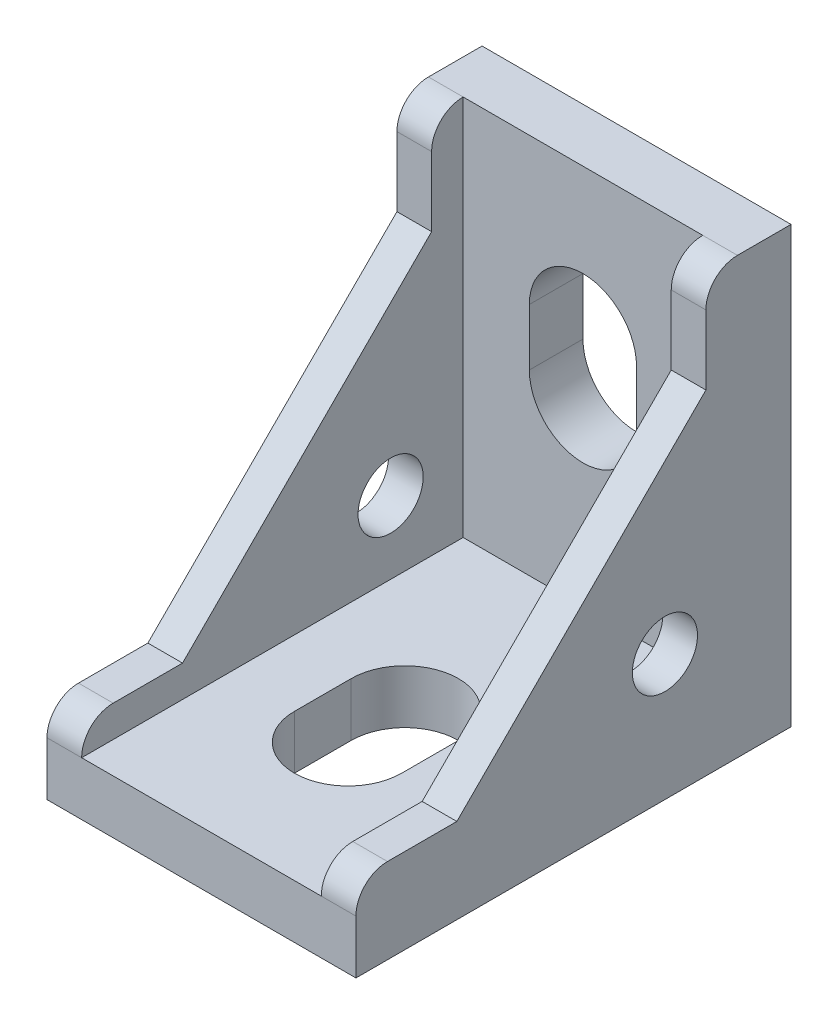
ISO-10303-21;
HEADER;
FILE_DESCRIPTION(('STEP AP214'),'2;1');
FILE_NAME('part.step','',(''),(''),'','','');
FILE_SCHEMA(('AUTOMOTIVE_DESIGN { 1 0 10303 214 1 1 1 1 }'));
ENDSEC;
DATA;
#1=APPLICATION_CONTEXT('core data for automotive mechanical design processes');
#2=APPLICATION_PROTOCOL_DEFINITION('international standard','automotive_design',2000,#1);
#3=PRODUCT_CONTEXT('',#1,'mechanical');
#4=PRODUCT('Part','Part','',(#3));
#5=PRODUCT_RELATED_PRODUCT_CATEGORY('part','',(#4));
#6=PRODUCT_DEFINITION_FORMATION('','',#4);
#7=PRODUCT_DEFINITION_CONTEXT('part definition',#1,'design');
#8=PRODUCT_DEFINITION('design','',#6,#7);
#9=PRODUCT_DEFINITION_SHAPE('','',#8);
#10=(LENGTH_UNIT() NAMED_UNIT(*) SI_UNIT(.MILLI.,.METRE.));
#11=(NAMED_UNIT(*) PLANE_ANGLE_UNIT() SI_UNIT($,.RADIAN.));
#12=(NAMED_UNIT(*) SI_UNIT($,.STERADIAN.) SOLID_ANGLE_UNIT());
#13=UNCERTAINTY_MEASURE_WITH_UNIT(LENGTH_MEASURE(1.E-05),#10,'distance_accuracy_value','');
#14=(GEOMETRIC_REPRESENTATION_CONTEXT(3) GLOBAL_UNCERTAINTY_ASSIGNED_CONTEXT((#13)) GLOBAL_UNIT_ASSIGNED_CONTEXT((#10,
#11,#12)) REPRESENTATION_CONTEXT('',''));
#15=CARTESIAN_POINT('',(0.,0.,0.));
#16=DIRECTION('',(0.,0.,1.));
#17=DIRECTION('',(1.,0.,0.));
#18=AXIS2_PLACEMENT_3D('',#15,#16,#17);
#19=CARTESIAN_POINT('',(-9.8,0.,0.));
#20=DIRECTION('',(1.,0.,0.));
#21=DIRECTION('',(0.,0.,-1.));
#22=AXIS2_PLACEMENT_3D('',#19,#20,#21);
#23=PLANE('',#22);
#24=DIRECTION('',(0.,-1.,0.));
#25=VECTOR('',#24,1.);
#26=CARTESIAN_POINT('',(-9.8,0.,27.6));
#27=LINE('',#26,#25);
#28=CARTESIAN_POINT('',(-9.8,3.39999999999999,27.6));
#29=VERTEX_POINT('',#28);
#30=CARTESIAN_POINT('',(-9.8,0.,27.6));
#31=VERTEX_POINT('',#30);
#32=EDGE_CURVE('E530',#29,#31,#27,.T.);
#33=ORIENTED_EDGE('',*,*,#32,.F.);
#34=CARTESIAN_POINT('',(-9.8,3.4,25.6));
#35=DIRECTION('',(1.,0.,0.));
#36=DIRECTION('',(0.,0.,-1.));
#37=AXIS2_PLACEMENT_3D('',#34,#35,#36);
#38=CIRCLE('',#37,2.);
#39=CARTESIAN_POINT('',(-9.8,5.4,25.6));
#40=VERTEX_POINT('',#39);
#41=EDGE_CURVE('E567',#29,#40,#38,.F.);
#42=ORIENTED_EDGE('',*,*,#41,.T.);
#43=DIRECTION('',(0.,0.,1.));
#44=VECTOR('',#43,1.);
#45=CARTESIAN_POINT('',(-9.8,5.4,21.2));
#46=LINE('',#45,#44);
#47=CARTESIAN_POINT('',(-9.8,5.4,21.2));
#48=VERTEX_POINT('',#47);
#49=EDGE_CURVE('E466',#48,#40,#46,.T.);
#50=ORIENTED_EDGE('',*,*,#49,.F.);
#51=DIRECTION('',(0.,-0.707106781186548,0.707106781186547));
#52=VECTOR('',#51,1.);
#53=CARTESIAN_POINT('',(-9.8,21.2,5.4));
#54=LINE('',#53,#52);
#55=CARTESIAN_POINT('',(-9.8,21.2,5.4));
#56=VERTEX_POINT('',#55);
#57=EDGE_CURVE('E474',#56,#48,#54,.T.);
#58=ORIENTED_EDGE('',*,*,#57,.F.);
#59=DIRECTION('',(0.,-1.,0.));
#60=VECTOR('',#59,1.);
#61=CARTESIAN_POINT('',(-9.8,27.6,5.4));
#62=LINE('',#61,#60);
#63=CARTESIAN_POINT('',(-9.8,25.6,5.4));
#64=VERTEX_POINT('',#63);
#65=EDGE_CURVE('E456',#64,#56,#62,.T.);
#66=ORIENTED_EDGE('',*,*,#65,.F.);
#67=CARTESIAN_POINT('',(-9.8,25.6,3.4));
#68=DIRECTION('',(1.,0.,0.));
#69=DIRECTION('',(0.,0.,-1.));
#70=AXIS2_PLACEMENT_3D('',#67,#68,#69);
#71=CIRCLE('',#70,2.);
#72=CARTESIAN_POINT('',(-9.8,27.6,3.4));
#73=VERTEX_POINT('',#72);
#74=EDGE_CURVE('E565',#64,#73,#71,.F.);
#75=ORIENTED_EDGE('',*,*,#74,.T.);
#76=DIRECTION('',(0.,0.,1.));
#77=VECTOR('',#76,1.);
#78=CARTESIAN_POINT('',(-9.8,27.6,0.));
#79=LINE('',#78,#77);
#80=CARTESIAN_POINT('',(-9.8,27.6,0.));
#81=VERTEX_POINT('',#80);
#82=EDGE_CURVE('E527',#81,#73,#79,.T.);
#83=ORIENTED_EDGE('',*,*,#82,.F.);
#84=DIRECTION('',(0.,1.,0.));
#85=VECTOR('',#84,1.);
#86=CARTESIAN_POINT('',(-9.8,0.,0.));
#87=LINE('',#86,#85);
#88=CARTESIAN_POINT('',(-9.8,0.,0.));
#89=VERTEX_POINT('',#88);
#90=EDGE_CURVE('E513',#89,#81,#87,.T.);
#91=ORIENTED_EDGE('',*,*,#90,.F.);
#92=DIRECTION('',(0.,0.,-1.));
#93=VECTOR('',#92,1.);
#94=CARTESIAN_POINT('',(-9.8,0.,0.));
#95=LINE('',#94,#93);
#96=EDGE_CURVE('E518',#31,#89,#95,.T.);
#97=ORIENTED_EDGE('',*,*,#96,.F.);
#98=EDGE_LOOP('',(#33,#42,#50,#58,#66,#75,#83,#91,#97));
#99=FACE_BOUND('',#98,.T.);
#100=CARTESIAN_POINT('',(-9.8,8.,8.));
#101=DIRECTION('',(-1.,0.,0.));
#102=DIRECTION('',(0.,0.,1.));
#103=AXIS2_PLACEMENT_3D('',#100,#101,#102);
#104=CIRCLE('',#103,2.067);
#105=CARTESIAN_POINT('',(-9.8,8.,10.067));
#106=VERTEX_POINT('',#105);
#107=EDGE_CURVE('E637',#106,#106,#104,.T.);
#108=ORIENTED_EDGE('',*,*,#107,.F.);
#109=EDGE_LOOP('',(#108));
#110=FACE_BOUND('',#109,.T.);
#111=ADVANCED_FACE('F38',(#99,#110),#23,.F.);
#112=CARTESIAN_POINT('',(9.8,0.,0.));
#113=DIRECTION('',(0.,1.,0.));
#114=DIRECTION('',(0.,0.,1.));
#115=AXIS2_PLACEMENT_3D('',#112,#113,#114);
#116=PLANE('',#115);
#117=DIRECTION('',(0.,0.,-1.));
#118=VECTOR('',#117,1.);
#119=CARTESIAN_POINT('',(-2.9,0.,4.5));
#120=LINE('',#119,#118);
#121=CARTESIAN_POINT('',(-2.9,0.,4.5));
#122=VERTEX_POINT('',#121);
#123=CARTESIAN_POINT('',(-2.9,0.,1.5));
#124=VERTEX_POINT('',#123);
#125=EDGE_CURVE('E309',#122,#124,#120,.T.);
#126=ORIENTED_EDGE('',*,*,#125,.F.);
#127=DIRECTION('',(-1.,0.,0.));
#128=VECTOR('',#127,1.);
#129=CARTESIAN_POINT('',(-2.9,0.,4.5));
#130=LINE('',#129,#128);
#131=CARTESIAN_POINT('',(2.9,0.,4.5));
#132=VERTEX_POINT('',#131);
#133=EDGE_CURVE('E295',#132,#122,#130,.T.);
#134=ORIENTED_EDGE('',*,*,#133,.F.);
#135=DIRECTION('',(0.,0.,1.));
#136=VECTOR('',#135,1.);
#137=CARTESIAN_POINT('',(2.9,0.,4.5));
#138=LINE('',#137,#136);
#139=CARTESIAN_POINT('',(2.9,0.,1.5));
#140=VERTEX_POINT('',#139);
#141=EDGE_CURVE('E306',#140,#132,#138,.T.);
#142=ORIENTED_EDGE('',*,*,#141,.F.);
#143=DIRECTION('',(1.,0.,0.));
#144=VECTOR('',#143,1.);
#145=CARTESIAN_POINT('',(-2.9,0.,1.5));
#146=LINE('',#145,#144);
#147=EDGE_CURVE('E316',#124,#140,#146,.T.);
#148=ORIENTED_EDGE('',*,*,#147,.F.);
#149=EDGE_LOOP('',(#126,#134,#142,#148));
#150=FACE_BOUND('',#149,.T.);
#151=DIRECTION('',(0.,0.,-1.));
#152=VECTOR('',#151,1.);
#153=CARTESIAN_POINT('',(-2.9,0.,26.1));
#154=LINE('',#153,#152);
#155=CARTESIAN_POINT('',(-2.9,0.,26.1));
#156=VERTEX_POINT('',#155);
#157=CARTESIAN_POINT('',(-2.9,0.,23.1));
#158=VERTEX_POINT('',#157);
#159=EDGE_CURVE('E326',#156,#158,#154,.T.);
#160=ORIENTED_EDGE('',*,*,#159,.F.);
#161=DIRECTION('',(-1.,0.,0.));
#162=VECTOR('',#161,1.);
#163=CARTESIAN_POINT('',(-2.9,0.,26.1));
#164=LINE('',#163,#162);
#165=CARTESIAN_POINT('',(2.9,0.,26.1));
#166=VERTEX_POINT('',#165);
#167=EDGE_CURVE('E330',#166,#156,#164,.T.);
#168=ORIENTED_EDGE('',*,*,#167,.F.);
#169=DIRECTION('',(0.,0.,1.));
#170=VECTOR('',#169,1.);
#171=CARTESIAN_POINT('',(2.9,0.,26.1));
#172=LINE('',#171,#170);
#173=CARTESIAN_POINT('',(2.9,0.,23.1));
#174=VERTEX_POINT('',#173);
#175=EDGE_CURVE('E341',#174,#166,#172,.T.);
#176=ORIENTED_EDGE('',*,*,#175,.F.);
#177=DIRECTION('',(1.,0.,0.));
#178=VECTOR('',#177,1.);
#179=CARTESIAN_POINT('',(-2.9,0.,23.1));
#180=LINE('',#179,#178);
#181=EDGE_CURVE('E338',#158,#174,#180,.T.);
#182=ORIENTED_EDGE('',*,*,#181,.F.);
#183=EDGE_LOOP('',(#160,#168,#176,#182));
#184=FACE_BOUND('',#183,.T.);
#185=DIRECTION('',(0.,0.,-1.));
#186=VECTOR('',#185,1.);
#187=CARTESIAN_POINT('',(3.4,0.,14.7));
#188=LINE('',#187,#186);
#189=CARTESIAN_POINT('',(3.4,0.,18.3));
#190=VERTEX_POINT('',#189);
#191=CARTESIAN_POINT('',(3.4,0.,14.7));
#192=VERTEX_POINT('',#191);
#193=EDGE_CURVE('E409',#190,#192,#188,.T.);
#194=ORIENTED_EDGE('',*,*,#193,.T.);
#195=CARTESIAN_POINT('',(0.,0.,14.7));
#196=DIRECTION('',(0.,1.,0.));
#197=DIRECTION('',(0.,0.,1.));
#198=AXIS2_PLACEMENT_3D('',#195,#196,#197);
#199=CIRCLE('',#198,3.4);
#200=CARTESIAN_POINT('',(-3.4,0.,14.7));
#201=VERTEX_POINT('',#200);
#202=EDGE_CURVE('E399',#192,#201,#199,.T.);
#203=ORIENTED_EDGE('',*,*,#202,.T.);
#204=DIRECTION('',(0.,0.,1.));
#205=VECTOR('',#204,1.);
#206=CARTESIAN_POINT('',(-3.4,0.,14.7));
#207=LINE('',#206,#205);
#208=CARTESIAN_POINT('',(-3.4,0.,18.3));
#209=VERTEX_POINT('',#208);
#210=EDGE_CURVE('E402',#201,#209,#207,.T.);
#211=ORIENTED_EDGE('',*,*,#210,.T.);
#212=CARTESIAN_POINT('',(0.,0.,18.3));
#213=DIRECTION('',(0.,1.,0.));
#214=DIRECTION('',(0.,0.,1.));
#215=AXIS2_PLACEMENT_3D('',#212,#213,#214);
#216=CIRCLE('',#215,3.4);
#217=EDGE_CURVE('E406',#209,#190,#216,.T.);
#218=ORIENTED_EDGE('',*,*,#217,.T.);
#219=EDGE_LOOP('',(#194,#203,#211,#218));
#220=FACE_BOUND('',#219,.T.);
#221=ORIENTED_EDGE('',*,*,#96,.T.);
#222=DIRECTION('',(-1.,0.,0.));
#223=VECTOR('',#222,1.);
#224=CARTESIAN_POINT('',(9.8,0.,0.));
#225=LINE('',#224,#223);
#226=CARTESIAN_POINT('',(9.8,0.,0.));
#227=VERTEX_POINT('',#226);
#228=EDGE_CURVE('E525',#227,#89,#225,.T.);
#229=ORIENTED_EDGE('',*,*,#228,.F.);
#230=DIRECTION('',(0.,0.,-1.));
#231=VECTOR('',#230,1.);
#232=CARTESIAN_POINT('',(9.8,0.,0.));
#233=LINE('',#232,#231);
#234=CARTESIAN_POINT('',(9.8,0.,27.6));
#235=VERTEX_POINT('',#234);
#236=EDGE_CURVE('E523',#235,#227,#233,.T.);
#237=ORIENTED_EDGE('',*,*,#236,.F.);
#238=DIRECTION('',(-1.,0.,0.));
#239=VECTOR('',#238,1.);
#240=CARTESIAN_POINT('',(9.8,0.,27.6));
#241=LINE('',#240,#239);
#242=EDGE_CURVE('E535',#235,#31,#241,.T.);
#243=ORIENTED_EDGE('',*,*,#242,.T.);
#244=EDGE_LOOP('',(#221,#229,#237,#243));
#245=FACE_BOUND('',#244,.T.);
#246=ADVANCED_FACE('F304',(#150,#184,#220,#245),#116,.F.);
#247=CARTESIAN_POINT('',(9.8,0.,0.));
#248=DIRECTION('',(0.,0.,1.));
#249=DIRECTION('',(1.,0.,0.));
#250=AXIS2_PLACEMENT_3D('',#247,#248,#249);
#251=PLANE('',#250);
#252=ORIENTED_EDGE('',*,*,#90,.T.);
#253=DIRECTION('',(-1.,0.,0.));
#254=VECTOR('',#253,1.);
#255=CARTESIAN_POINT('',(9.8,27.6,0.));
#256=LINE('',#255,#254);
#257=CARTESIAN_POINT('',(9.8,27.6,0.));
#258=VERTEX_POINT('',#257);
#259=EDGE_CURVE('E538',#258,#81,#256,.T.);
#260=ORIENTED_EDGE('',*,*,#259,.F.);
#261=DIRECTION('',(0.,1.,0.));
#262=VECTOR('',#261,1.);
#263=CARTESIAN_POINT('',(9.8,0.,0.));
#264=LINE('',#263,#262);
#265=EDGE_CURVE('E514',#227,#258,#264,.T.);
#266=ORIENTED_EDGE('',*,*,#265,.F.);
#267=ORIENTED_EDGE('',*,*,#228,.T.);
#268=EDGE_LOOP('',(#252,#260,#266,#267));
#269=FACE_BOUND('',#268,.T.);
#270=DIRECTION('',(1.,0.,0.));
#271=VECTOR('',#270,1.);
#272=CARTESIAN_POINT('',(2.9,26.1,0.));
#273=LINE('',#272,#271);
#274=CARTESIAN_POINT('',(-2.9,26.1,0.));
#275=VERTEX_POINT('',#274);
#276=CARTESIAN_POINT('',(2.90000000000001,26.1,0.));
#277=VERTEX_POINT('',#276);
#278=EDGE_CURVE('E378',#275,#277,#273,.T.);
#279=ORIENTED_EDGE('',*,*,#278,.F.);
#280=DIRECTION('',(0.,1.,0.));
#281=VECTOR('',#280,1.);
#282=CARTESIAN_POINT('',(-2.9,26.1,0.));
#283=LINE('',#282,#281);
#284=CARTESIAN_POINT('',(-2.9,23.1,0.));
#285=VERTEX_POINT('',#284);
#286=EDGE_CURVE('E389',#285,#275,#283,.T.);
#287=ORIENTED_EDGE('',*,*,#286,.F.);
#288=DIRECTION('',(-1.,0.,0.));
#289=VECTOR('',#288,1.);
#290=CARTESIAN_POINT('',(2.9,23.1,0.));
#291=LINE('',#290,#289);
#292=CARTESIAN_POINT('',(2.9,23.1,0.));
#293=VERTEX_POINT('',#292);
#294=EDGE_CURVE('E386',#293,#285,#291,.T.);
#295=ORIENTED_EDGE('',*,*,#294,.F.);
#296=DIRECTION('',(0.,-1.,0.));
#297=VECTOR('',#296,1.);
#298=CARTESIAN_POINT('',(2.9,26.1,0.));
#299=LINE('',#298,#297);
#300=EDGE_CURVE('E374',#277,#293,#299,.T.);
#301=ORIENTED_EDGE('',*,*,#300,.F.);
#302=EDGE_LOOP('',(#279,#287,#295,#301));
#303=FACE_BOUND('',#302,.T.);
#304=DIRECTION('',(0.,-1.,0.));
#305=VECTOR('',#304,1.);
#306=CARTESIAN_POINT('',(-3.4,14.7,0.));
#307=LINE('',#306,#305);
#308=CARTESIAN_POINT('',(-3.4,18.3,0.));
#309=VERTEX_POINT('',#308);
#310=CARTESIAN_POINT('',(-3.4,14.7,0.));
#311=VERTEX_POINT('',#310);
#312=EDGE_CURVE('E441',#309,#311,#307,.T.);
#313=ORIENTED_EDGE('',*,*,#312,.T.);
#314=CARTESIAN_POINT('',(0.,14.7,0.));
#315=DIRECTION('',(0.,0.,1.));
#316=DIRECTION('',(1.,0.,0.));
#317=AXIS2_PLACEMENT_3D('',#314,#315,#316);
#318=CIRCLE('',#317,3.4);
#319=CARTESIAN_POINT('',(3.4,14.7,0.));
#320=VERTEX_POINT('',#319);
#321=EDGE_CURVE('E431',#311,#320,#318,.T.);
#322=ORIENTED_EDGE('',*,*,#321,.T.);
#323=DIRECTION('',(0.,1.,0.));
#324=VECTOR('',#323,1.);
#325=CARTESIAN_POINT('',(3.4,14.7,0.));
#326=LINE('',#325,#324);
#327=CARTESIAN_POINT('',(3.4,18.3,0.));
#328=VERTEX_POINT('',#327);
#329=EDGE_CURVE('E434',#320,#328,#326,.T.);
#330=ORIENTED_EDGE('',*,*,#329,.T.);
#331=CARTESIAN_POINT('',(0.,18.3,0.));
#332=DIRECTION('',(0.,0.,1.));
#333=DIRECTION('',(1.,0.,0.));
#334=AXIS2_PLACEMENT_3D('',#331,#332,#333);
#335=CIRCLE('',#334,3.4);
#336=EDGE_CURVE('E438',#328,#309,#335,.T.);
#337=ORIENTED_EDGE('',*,*,#336,.T.);
#338=EDGE_LOOP('',(#313,#322,#330,#337));
#339=FACE_BOUND('',#338,.T.);
#340=DIRECTION('',(0.,-1.,0.));
#341=VECTOR('',#340,1.);
#342=CARTESIAN_POINT('',(2.9,4.5,0.));
#343=LINE('',#342,#341);
#344=CARTESIAN_POINT('',(2.9,4.5,0.));
#345=VERTEX_POINT('',#344);
#346=CARTESIAN_POINT('',(2.9,1.5,0.));
#347=VERTEX_POINT('',#346);
#348=EDGE_CURVE('E350',#345,#347,#343,.T.);
#349=ORIENTED_EDGE('',*,*,#348,.F.);
#350=DIRECTION('',(1.,0.,0.));
#351=VECTOR('',#350,1.);
#352=CARTESIAN_POINT('',(2.9,4.5,0.));
#353=LINE('',#352,#351);
#354=CARTESIAN_POINT('',(-2.90000000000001,4.5,0.));
#355=VERTEX_POINT('',#354);
#356=EDGE_CURVE('E354',#355,#345,#353,.T.);
#357=ORIENTED_EDGE('',*,*,#356,.F.);
#358=DIRECTION('',(0.,1.,0.));
#359=VECTOR('',#358,1.);
#360=CARTESIAN_POINT('',(-2.90000000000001,4.5,0.));
#361=LINE('',#360,#359);
#362=CARTESIAN_POINT('',(-2.90000000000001,1.5,0.));
#363=VERTEX_POINT('',#362);
#364=EDGE_CURVE('E365',#363,#355,#361,.T.);
#365=ORIENTED_EDGE('',*,*,#364,.F.);
#366=DIRECTION('',(-1.,0.,0.));
#367=VECTOR('',#366,1.);
#368=CARTESIAN_POINT('',(2.9,1.5,0.));
#369=LINE('',#368,#367);
#370=EDGE_CURVE('E362',#347,#363,#369,.T.);
#371=ORIENTED_EDGE('',*,*,#370,.F.);
#372=EDGE_LOOP('',(#349,#357,#365,#371));
#373=FACE_BOUND('',#372,.T.);
#374=ADVANCED_FACE('F650',(#269,#303,#339,#373),#251,.F.);
#375=CARTESIAN_POINT('',(9.8,27.6,0.));
#376=DIRECTION('',(0.,-1.,0.));
#377=DIRECTION('',(0.,0.,-1.));
#378=AXIS2_PLACEMENT_3D('',#375,#376,#377);
#379=PLANE('',#378);
#380=DIRECTION('',(-1.,0.,0.));
#381=VECTOR('',#380,1.);
#382=CARTESIAN_POINT('',(-7.6,27.6,3.4));
#383=LINE('',#382,#381);
#384=CARTESIAN_POINT('',(7.6,27.6,3.4));
#385=VERTEX_POINT('',#384);
#386=CARTESIAN_POINT('',(-7.6,27.6,3.4));
#387=VERTEX_POINT('',#386);
#388=EDGE_CURVE('E494',#385,#387,#383,.T.);
#389=ORIENTED_EDGE('',*,*,#388,.F.);
#390=DIRECTION('',(-1.,0.,0.));
#391=VECTOR('',#390,1.);
#392=CARTESIAN_POINT('',(9.8,27.6,3.4));
#393=LINE('',#392,#391);
#394=CARTESIAN_POINT('',(9.8,27.6,3.4));
#395=VERTEX_POINT('',#394);
#396=EDGE_CURVE('E580',#385,#395,#393,.F.);
#397=ORIENTED_EDGE('',*,*,#396,.T.);
#398=DIRECTION('',(0.,0.,1.));
#399=VECTOR('',#398,1.);
#400=CARTESIAN_POINT('',(9.8,27.6,0.));
#401=LINE('',#400,#399);
#402=EDGE_CURVE('E517',#258,#395,#401,.T.);
#403=ORIENTED_EDGE('',*,*,#402,.F.);
#404=ORIENTED_EDGE('',*,*,#259,.T.);
#405=ORIENTED_EDGE('',*,*,#82,.T.);
#406=DIRECTION('',(-1.,0.,0.));
#407=VECTOR('',#406,1.);
#408=CARTESIAN_POINT('',(9.8,27.6,3.4));
#409=LINE('',#408,#407);
#410=EDGE_CURVE('E578',#73,#387,#409,.F.);
#411=ORIENTED_EDGE('',*,*,#410,.T.);
#412=EDGE_LOOP('',(#389,#397,#403,#404,#405,#411));
#413=FACE_BOUND('',#412,.T.);
#414=ADVANCED_FACE('F660',(#413),#379,.F.);
#415=CARTESIAN_POINT('',(9.8,0.,27.6));
#416=DIRECTION('',(0.,0.,-1.));
#417=DIRECTION('',(-1.,0.,0.));
#418=AXIS2_PLACEMENT_3D('',#415,#416,#417);
#419=PLANE('',#418);
#420=DIRECTION('',(0.,-1.,0.));
#421=VECTOR('',#420,1.);
#422=CARTESIAN_POINT('',(9.8,0.,27.6));
#423=LINE('',#422,#421);
#424=CARTESIAN_POINT('',(9.8,3.39999999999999,27.6));
#425=VERTEX_POINT('',#424);
#426=EDGE_CURVE('E521',#425,#235,#423,.T.);
#427=ORIENTED_EDGE('',*,*,#426,.F.);
#428=DIRECTION('',(-1.,0.,0.));
#429=VECTOR('',#428,1.);
#430=CARTESIAN_POINT('',(9.8,3.4,27.6));
#431=LINE('',#430,#429);
#432=CARTESIAN_POINT('',(7.60000000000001,3.4,27.6));
#433=VERTEX_POINT('',#432);
#434=EDGE_CURVE('E552',#425,#433,#431,.T.);
#435=ORIENTED_EDGE('',*,*,#434,.T.);
#436=DIRECTION('',(-1.,0.,0.));
#437=VECTOR('',#436,1.);
#438=CARTESIAN_POINT('',(-7.6,3.4,27.6));
#439=LINE('',#438,#437);
#440=CARTESIAN_POINT('',(-7.6,3.4,27.6));
#441=VERTEX_POINT('',#440);
#442=EDGE_CURVE('E503',#433,#441,#439,.T.);
#443=ORIENTED_EDGE('',*,*,#442,.T.);
#444=DIRECTION('',(-1.,0.,0.));
#445=VECTOR('',#444,1.);
#446=CARTESIAN_POINT('',(9.8,3.4,27.6));
#447=LINE('',#446,#445);
#448=EDGE_CURVE('E549',#441,#29,#447,.T.);
#449=ORIENTED_EDGE('',*,*,#448,.T.);
#450=ORIENTED_EDGE('',*,*,#32,.T.);
#451=ORIENTED_EDGE('',*,*,#242,.F.);
#452=EDGE_LOOP('',(#427,#435,#443,#449,#450,#451));
#453=FACE_BOUND('',#452,.T.);
#454=ADVANCED_FACE('F657',(#453),#419,.F.);
#455=CARTESIAN_POINT('',(9.8,0.,0.));
#456=DIRECTION('',(1.,0.,0.));
#457=DIRECTION('',(0.,0.,-1.));
#458=AXIS2_PLACEMENT_3D('',#455,#456,#457);
#459=PLANE('',#458);
#460=CARTESIAN_POINT('',(9.8,8.,8.));
#461=DIRECTION('',(-1.,0.,0.));
#462=DIRECTION('',(0.,0.,1.));
#463=AXIS2_PLACEMENT_3D('',#460,#461,#462);
#464=CIRCLE('',#463,2.067);
#465=CARTESIAN_POINT('',(9.8,8.,10.067));
#466=VERTEX_POINT('',#465);
#467=EDGE_CURVE('E634',#466,#466,#464,.T.);
#468=ORIENTED_EDGE('',*,*,#467,.T.);
#469=EDGE_LOOP('',(#468));
#470=FACE_BOUND('',#469,.T.);
#471=DIRECTION('',(0.,0.,1.));
#472=VECTOR('',#471,1.);
#473=CARTESIAN_POINT('',(9.8,5.4,21.2));
#474=LINE('',#473,#472);
#475=CARTESIAN_POINT('',(9.8,5.4,21.2));
#476=VERTEX_POINT('',#475);
#477=CARTESIAN_POINT('',(9.8,5.4,25.6));
#478=VERTEX_POINT('',#477);
#479=EDGE_CURVE('E469',#476,#478,#474,.T.);
#480=ORIENTED_EDGE('',*,*,#479,.T.);
#481=CARTESIAN_POINT('',(9.8,3.4,25.6));
#482=DIRECTION('',(1.,0.,0.));
#483=DIRECTION('',(0.,0.,-1.));
#484=AXIS2_PLACEMENT_3D('',#481,#482,#483);
#485=CIRCLE('',#484,2.);
#486=EDGE_CURVE('E563',#478,#425,#485,.T.);
#487=ORIENTED_EDGE('',*,*,#486,.T.);
#488=ORIENTED_EDGE('',*,*,#426,.T.);
#489=ORIENTED_EDGE('',*,*,#236,.T.);
#490=ORIENTED_EDGE('',*,*,#265,.T.);
#491=ORIENTED_EDGE('',*,*,#402,.T.);
#492=CARTESIAN_POINT('',(9.8,25.6,3.4));
#493=DIRECTION('',(1.,0.,0.));
#494=DIRECTION('',(0.,0.,-1.));
#495=AXIS2_PLACEMENT_3D('',#492,#493,#494);
#496=CIRCLE('',#495,2.);
#497=CARTESIAN_POINT('',(9.8,25.6,5.4));
#498=VERTEX_POINT('',#497);
#499=EDGE_CURVE('E561',#395,#498,#496,.T.);
#500=ORIENTED_EDGE('',*,*,#499,.T.);
#501=DIRECTION('',(0.,-1.,0.));
#502=VECTOR('',#501,1.);
#503=CARTESIAN_POINT('',(9.8,27.6,5.4));
#504=LINE('',#503,#502);
#505=CARTESIAN_POINT('',(9.8,21.2,5.4));
#506=VERTEX_POINT('',#505);
#507=EDGE_CURVE('E463',#498,#506,#504,.T.);
#508=ORIENTED_EDGE('',*,*,#507,.T.);
#509=DIRECTION('',(0.,-0.707106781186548,0.707106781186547));
#510=VECTOR('',#509,1.);
#511=CARTESIAN_POINT('',(9.8,21.2,5.4));
#512=LINE('',#511,#510);
#513=EDGE_CURVE('E465',#506,#476,#512,.T.);
#514=ORIENTED_EDGE('',*,*,#513,.T.);
#515=EDGE_LOOP('',(#480,#487,#488,#489,#490,#491,#500,#508,#514));
#516=FACE_BOUND('',#515,.T.);
#517=ADVANCED_FACE('F654',(#470,#516),#459,.T.);
#518=CARTESIAN_POINT('',(-7.6,-28.5776136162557,27.6));
#519=DIRECTION('',(-1.,0.,0.));
#520=DIRECTION('',(0.,0.,1.));
#521=AXIS2_PLACEMENT_3D('',#518,#519,#520);
#522=PLANE('',#521);
#523=CARTESIAN_POINT('',(-7.6,8.,8.));
#524=DIRECTION('',(-1.,0.,0.));
#525=DIRECTION('',(0.,0.,1.));
#526=AXIS2_PLACEMENT_3D('',#523,#524,#525);
#527=CIRCLE('',#526,2.067);
#528=CARTESIAN_POINT('',(-7.6,8.,10.067));
#529=VERTEX_POINT('',#528);
#530=EDGE_CURVE('E631',#529,#529,#527,.T.);
#531=ORIENTED_EDGE('',*,*,#530,.T.);
#532=EDGE_LOOP('',(#531));
#533=FACE_BOUND('',#532,.T.);
#534=DIRECTION('',(0.,0.,1.));
#535=VECTOR('',#534,1.);
#536=CARTESIAN_POINT('',(-7.6,5.4,27.6));
#537=LINE('',#536,#535);
#538=CARTESIAN_POINT('',(-7.6,5.4,21.2));
#539=VERTEX_POINT('',#538);
#540=CARTESIAN_POINT('',(-7.6,5.4,25.6));
#541=VERTEX_POINT('',#540);
#542=EDGE_CURVE('E491',#539,#541,#537,.T.);
#543=ORIENTED_EDGE('',*,*,#542,.T.);
#544=CARTESIAN_POINT('',(-7.6,3.4,25.6));
#545=DIRECTION('',(-1.,0.,0.));
#546=DIRECTION('',(0.,0.,1.));
#547=AXIS2_PLACEMENT_3D('',#544,#545,#546);
#548=CIRCLE('',#547,2.);
#549=EDGE_CURVE('E573',#541,#441,#548,.F.);
#550=ORIENTED_EDGE('',*,*,#549,.T.);
#551=DIRECTION('',(0.,0.,-1.));
#552=VECTOR('',#551,1.);
#553=CARTESIAN_POINT('',(-7.6,3.4,27.6));
#554=LINE('',#553,#552);
#555=CARTESIAN_POINT('',(-7.6,3.4,3.4));
#556=VERTEX_POINT('',#555);
#557=EDGE_CURVE('E501',#441,#556,#554,.T.);
#558=ORIENTED_EDGE('',*,*,#557,.T.);
#559=DIRECTION('',(0.,1.,0.));
#560=VECTOR('',#559,1.);
#561=CARTESIAN_POINT('',(-7.6,-28.5776136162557,3.4));
#562=LINE('',#561,#560);
#563=EDGE_CURVE('E499',#556,#387,#562,.T.);
#564=ORIENTED_EDGE('',*,*,#563,.T.);
#565=CARTESIAN_POINT('',(-7.6,25.6,3.4));
#566=DIRECTION('',(-1.,0.,0.));
#567=DIRECTION('',(0.,0.,1.));
#568=AXIS2_PLACEMENT_3D('',#565,#566,#567);
#569=CIRCLE('',#568,2.);
#570=CARTESIAN_POINT('',(-7.6,25.6,5.4));
#571=VERTEX_POINT('',#570);
#572=EDGE_CURVE('E571',#387,#571,#569,.F.);
#573=ORIENTED_EDGE('',*,*,#572,.T.);
#574=DIRECTION('',(0.,-1.,0.));
#575=VECTOR('',#574,1.);
#576=CARTESIAN_POINT('',(-7.6,-28.5776136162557,5.40000000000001));
#577=LINE('',#576,#575);
#578=CARTESIAN_POINT('',(-7.6,21.2,5.4));
#579=VERTEX_POINT('',#578);
#580=EDGE_CURVE('E482',#571,#579,#577,.T.);
#581=ORIENTED_EDGE('',*,*,#580,.T.);
#582=DIRECTION('',(0.,-0.707106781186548,0.707106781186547));
#583=VECTOR('',#582,1.);
#584=CARTESIAN_POINT('',(-7.6,-14.7888068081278,41.3888068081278));
#585=LINE('',#584,#583);
#586=EDGE_CURVE('E488',#579,#539,#585,.T.);
#587=ORIENTED_EDGE('',*,*,#586,.T.);
#588=EDGE_LOOP('',(#543,#550,#558,#564,#573,#581,#587));
#589=FACE_BOUND('',#588,.T.);
#590=ADVANCED_FACE('F716',(#533,#589),#522,.F.);
#591=CARTESIAN_POINT('',(7.60000000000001,-28.5776136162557,27.6));
#592=DIRECTION('',(1.,0.,0.));
#593=DIRECTION('',(0.,0.,-1.));
#594=AXIS2_PLACEMENT_3D('',#591,#592,#593);
#595=PLANE('',#594);
#596=CARTESIAN_POINT('',(7.6,8.,8.));
#597=DIRECTION('',(1.,0.,0.));
#598=DIRECTION('',(0.,0.,-1.));
#599=AXIS2_PLACEMENT_3D('',#596,#597,#598);
#600=CIRCLE('',#599,2.067);
#601=CARTESIAN_POINT('',(7.6,8.,5.933));
#602=VERTEX_POINT('',#601);
#603=EDGE_CURVE('E300',#602,#602,#600,.T.);
#604=ORIENTED_EDGE('',*,*,#603,.T.);
#605=EDGE_LOOP('',(#604));
#606=FACE_BOUND('',#605,.T.);
#607=DIRECTION('',(0.,0.,1.));
#608=VECTOR('',#607,1.);
#609=CARTESIAN_POINT('',(7.60000000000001,3.4,27.6));
#610=LINE('',#609,#608);
#611=CARTESIAN_POINT('',(7.6,3.4,3.4));
#612=VERTEX_POINT('',#611);
#613=EDGE_CURVE('E495',#612,#433,#610,.T.);
#614=ORIENTED_EDGE('',*,*,#613,.T.);
#615=CARTESIAN_POINT('',(7.60000000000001,3.4,25.6));
#616=DIRECTION('',(1.,0.,0.));
#617=DIRECTION('',(0.,0.,-1.));
#618=AXIS2_PLACEMENT_3D('',#615,#616,#617);
#619=CIRCLE('',#618,2.);
#620=CARTESIAN_POINT('',(7.60000000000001,5.4,25.6));
#621=VERTEX_POINT('',#620);
#622=EDGE_CURVE('E557',#433,#621,#619,.F.);
#623=ORIENTED_EDGE('',*,*,#622,.T.);
#624=DIRECTION('',(0.,0.,-1.));
#625=VECTOR('',#624,1.);
#626=CARTESIAN_POINT('',(7.60000000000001,5.4,27.6));
#627=LINE('',#626,#625);
#628=CARTESIAN_POINT('',(7.6,5.4,21.2));
#629=VERTEX_POINT('',#628);
#630=EDGE_CURVE('E547',#621,#629,#627,.T.);
#631=ORIENTED_EDGE('',*,*,#630,.T.);
#632=DIRECTION('',(0.,0.707106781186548,-0.707106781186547));
#633=VECTOR('',#632,1.);
#634=CARTESIAN_POINT('',(7.60000000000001,-14.7888068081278,41.3888068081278));
#635=LINE('',#634,#633);
#636=CARTESIAN_POINT('',(7.6,21.2,5.4));
#637=VERTEX_POINT('',#636);
#638=EDGE_CURVE('E544',#629,#637,#635,.T.);
#639=ORIENTED_EDGE('',*,*,#638,.T.);
#640=DIRECTION('',(0.,1.,0.));
#641=VECTOR('',#640,1.);
#642=CARTESIAN_POINT('',(7.6,-28.5776136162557,5.40000000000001));
#643=LINE('',#642,#641);
#644=CARTESIAN_POINT('',(7.6,25.6,5.4));
#645=VERTEX_POINT('',#644);
#646=EDGE_CURVE('E541',#637,#645,#643,.T.);
#647=ORIENTED_EDGE('',*,*,#646,.T.);
#648=CARTESIAN_POINT('',(7.6,25.6,3.4));
#649=DIRECTION('',(1.,0.,0.));
#650=DIRECTION('',(0.,0.,-1.));
#651=AXIS2_PLACEMENT_3D('',#648,#649,#650);
#652=CIRCLE('',#651,2.);
#653=EDGE_CURVE('E555',#645,#385,#652,.F.);
#654=ORIENTED_EDGE('',*,*,#653,.T.);
#655=DIRECTION('',(0.,1.,0.));
#656=VECTOR('',#655,1.);
#657=CARTESIAN_POINT('',(7.6,-28.5776136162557,3.4));
#658=LINE('',#657,#656);
#659=EDGE_CURVE('E506',#612,#385,#658,.T.);
#660=ORIENTED_EDGE('',*,*,#659,.F.);
#661=EDGE_LOOP('',(#614,#623,#631,#639,#647,#654,#660));
#662=FACE_BOUND('',#661,.T.);
#663=ADVANCED_FACE('F708',(#606,#662),#595,.F.);
#664=CARTESIAN_POINT('',(-7.6,-28.5776136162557,3.4));
#665=DIRECTION('',(0.,0.,-1.));
#666=DIRECTION('',(0.,1.,0.));
#667=AXIS2_PLACEMENT_3D('',#664,#665,#666);
#668=PLANE('',#667);
#669=DIRECTION('',(0.,1.,0.));
#670=VECTOR('',#669,1.);
#671=CARTESIAN_POINT('',(3.4,14.7,3.4));
#672=LINE('',#671,#670);
#673=CARTESIAN_POINT('',(3.4,14.7,3.4));
#674=VERTEX_POINT('',#673);
#675=CARTESIAN_POINT('',(3.4,18.3,3.4));
#676=VERTEX_POINT('',#675);
#677=EDGE_CURVE('E446',#674,#676,#672,.T.);
#678=ORIENTED_EDGE('',*,*,#677,.F.);
#679=CARTESIAN_POINT('',(0.,14.7,3.4));
#680=DIRECTION('',(0.,0.,1.));
#681=DIRECTION('',(1.,0.,0.));
#682=AXIS2_PLACEMENT_3D('',#679,#680,#681);
#683=CIRCLE('',#682,3.4);
#684=CARTESIAN_POINT('',(-3.4,14.7,3.4));
#685=VERTEX_POINT('',#684);
#686=EDGE_CURVE('E424',#685,#674,#683,.T.);
#687=ORIENTED_EDGE('',*,*,#686,.F.);
#688=DIRECTION('',(0.,-1.,0.));
#689=VECTOR('',#688,1.);
#690=CARTESIAN_POINT('',(-3.4,14.7,3.4));
#691=LINE('',#690,#689);
#692=CARTESIAN_POINT('',(-3.4,18.3,3.4));
#693=VERTEX_POINT('',#692);
#694=EDGE_CURVE('E435',#693,#685,#691,.T.);
#695=ORIENTED_EDGE('',*,*,#694,.F.);
#696=CARTESIAN_POINT('',(0.,18.3,3.4));
#697=DIRECTION('',(0.,0.,1.));
#698=DIRECTION('',(1.,0.,0.));
#699=AXIS2_PLACEMENT_3D('',#696,#697,#698);
#700=CIRCLE('',#699,3.4);
#701=EDGE_CURVE('E449',#676,#693,#700,.T.);
#702=ORIENTED_EDGE('',*,*,#701,.F.);
#703=EDGE_LOOP('',(#678,#687,#695,#702));
#704=FACE_BOUND('',#703,.T.);
#705=DIRECTION('',(1.,0.,0.));
#706=VECTOR('',#705,1.);
#707=CARTESIAN_POINT('',(-7.6,3.4,3.4));
#708=LINE('',#707,#706);
#709=EDGE_CURVE('E498',#556,#612,#708,.T.);
#710=ORIENTED_EDGE('',*,*,#709,.T.);
#711=ORIENTED_EDGE('',*,*,#659,.T.);
#712=ORIENTED_EDGE('',*,*,#388,.T.);
#713=ORIENTED_EDGE('',*,*,#563,.F.);
#714=EDGE_LOOP('',(#710,#711,#712,#713));
#715=FACE_BOUND('',#714,.T.);
#716=ADVANCED_FACE('F733',(#704,#715),#668,.F.);
#717=CARTESIAN_POINT('',(9.8,3.4,0.));
#718=DIRECTION('',(0.,1.,0.));
#719=DIRECTION('',(0.,0.,1.));
#720=AXIS2_PLACEMENT_3D('',#717,#718,#719);
#721=PLANE('',#720);
#722=CARTESIAN_POINT('',(0.,3.4,14.7));
#723=DIRECTION('',(0.,1.,0.));
#724=DIRECTION('',(0.,0.,1.));
#725=AXIS2_PLACEMENT_3D('',#722,#723,#724);
#726=CIRCLE('',#725,3.4);
#727=CARTESIAN_POINT('',(3.4,3.4,14.7));
#728=VERTEX_POINT('',#727);
#729=CARTESIAN_POINT('',(-3.4,3.4,14.7));
#730=VERTEX_POINT('',#729);
#731=EDGE_CURVE('E398',#728,#730,#726,.T.);
#732=ORIENTED_EDGE('',*,*,#731,.F.);
#733=DIRECTION('',(0.,0.,-1.));
#734=VECTOR('',#733,1.);
#735=CARTESIAN_POINT('',(3.4,3.4,14.7));
#736=LINE('',#735,#734);
#737=CARTESIAN_POINT('',(3.4,3.4,18.3));
#738=VERTEX_POINT('',#737);
#739=EDGE_CURVE('E403',#738,#728,#736,.T.);
#740=ORIENTED_EDGE('',*,*,#739,.F.);
#741=CARTESIAN_POINT('',(0.,3.4,18.3));
#742=DIRECTION('',(0.,1.,0.));
#743=DIRECTION('',(0.,0.,1.));
#744=AXIS2_PLACEMENT_3D('',#741,#742,#743);
#745=CIRCLE('',#744,3.4);
#746=CARTESIAN_POINT('',(-3.4,3.4,18.3));
#747=VERTEX_POINT('',#746);
#748=EDGE_CURVE('E417',#747,#738,#745,.T.);
#749=ORIENTED_EDGE('',*,*,#748,.F.);
#750=DIRECTION('',(0.,0.,1.));
#751=VECTOR('',#750,1.);
#752=CARTESIAN_POINT('',(-3.4,3.4,14.7));
#753=LINE('',#752,#751);
#754=EDGE_CURVE('E414',#730,#747,#753,.T.);
#755=ORIENTED_EDGE('',*,*,#754,.F.);
#756=EDGE_LOOP('',(#732,#740,#749,#755));
#757=FACE_BOUND('',#756,.T.);
#758=ORIENTED_EDGE('',*,*,#557,.F.);
#759=ORIENTED_EDGE('',*,*,#442,.F.);
#760=ORIENTED_EDGE('',*,*,#613,.F.);
#761=ORIENTED_EDGE('',*,*,#709,.F.);
#762=EDGE_LOOP('',(#758,#759,#760,#761));
#763=FACE_BOUND('',#762,.T.);
#764=ADVANCED_FACE('F713',(#757,#763),#721,.T.);
#765=CARTESIAN_POINT('',(9.8,27.6,5.4));
#766=DIRECTION('',(0.,0.,-1.));
#767=DIRECTION('',(0.,1.,0.));
#768=AXIS2_PLACEMENT_3D('',#765,#766,#767);
#769=PLANE('',#768);
#770=ORIENTED_EDGE('',*,*,#507,.F.);
#771=DIRECTION('',(-1.,0.,0.));
#772=VECTOR('',#771,1.);
#773=CARTESIAN_POINT('',(9.8,25.6,5.4));
#774=LINE('',#773,#772);
#775=EDGE_CURVE('E575',#498,#645,#774,.T.);
#776=ORIENTED_EDGE('',*,*,#775,.T.);
#777=ORIENTED_EDGE('',*,*,#646,.F.);
#778=DIRECTION('',(-1.,0.,0.));
#779=VECTOR('',#778,1.);
#780=CARTESIAN_POINT('',(9.8,21.2,5.4));
#781=LINE('',#780,#779);
#782=EDGE_CURVE('E484',#506,#637,#781,.T.);
#783=ORIENTED_EDGE('',*,*,#782,.F.);
#784=EDGE_LOOP('',(#770,#776,#777,#783));
#785=FACE_BOUND('',#784,.T.);
#786=ADVANCED_FACE('F691',(#785),#769,.F.);
#787=CARTESIAN_POINT('',(9.8,21.2,5.4));
#788=DIRECTION('',(0.,-0.707106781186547,-0.707106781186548));
#789=DIRECTION('',(0.,0.707106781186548,-0.707106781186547));
#790=AXIS2_PLACEMENT_3D('',#787,#788,#789);
#791=PLANE('',#790);
#792=DIRECTION('',(-1.,0.,0.));
#793=VECTOR('',#792,1.);
#794=CARTESIAN_POINT('',(9.8,5.4,21.2));
#795=LINE('',#794,#793);
#796=EDGE_CURVE('E479',#476,#629,#795,.T.);
#797=ORIENTED_EDGE('',*,*,#796,.F.);
#798=ORIENTED_EDGE('',*,*,#513,.F.);
#799=ORIENTED_EDGE('',*,*,#782,.T.);
#800=ORIENTED_EDGE('',*,*,#638,.F.);
#801=EDGE_LOOP('',(#797,#798,#799,#800));
#802=FACE_BOUND('',#801,.T.);
#803=ADVANCED_FACE('F695',(#802),#791,.F.);
#804=CARTESIAN_POINT('',(9.8,5.4,21.2));
#805=DIRECTION('',(0.,-1.,0.));
#806=DIRECTION('',(0.,0.,-1.));
#807=AXIS2_PLACEMENT_3D('',#804,#805,#806);
#808=PLANE('',#807);
#809=ORIENTED_EDGE('',*,*,#630,.F.);
#810=DIRECTION('',(-1.,0.,0.));
#811=VECTOR('',#810,1.);
#812=CARTESIAN_POINT('',(9.8,5.4,25.6));
#813=LINE('',#812,#811);
#814=EDGE_CURVE('E559',#621,#478,#813,.F.);
#815=ORIENTED_EDGE('',*,*,#814,.T.);
#816=ORIENTED_EDGE('',*,*,#479,.F.);
#817=ORIENTED_EDGE('',*,*,#796,.T.);
#818=EDGE_LOOP('',(#809,#815,#816,#817));
#819=FACE_BOUND('',#818,.T.);
#820=ADVANCED_FACE('F748',(#819),#808,.F.);
#821=ORIENTED_EDGE('',*,*,#49,.T.);
#822=DIRECTION('',(-1.,0.,0.));
#823=VECTOR('',#822,1.);
#824=CARTESIAN_POINT('',(9.8,5.4,25.6));
#825=LINE('',#824,#823);
#826=EDGE_CURVE('E569',#40,#541,#825,.F.);
#827=ORIENTED_EDGE('',*,*,#826,.T.);
#828=ORIENTED_EDGE('',*,*,#542,.F.);
#829=EDGE_CURVE('E483',#539,#48,#795,.T.);
#830=ORIENTED_EDGE('',*,*,#829,.T.);
#831=EDGE_LOOP('',(#821,#827,#828,#830));
#832=FACE_BOUND('',#831,.T.);
#833=ADVANCED_FACE('F746',(#832),#808,.F.);
#834=EDGE_CURVE('E472',#579,#56,#781,.T.);
#835=ORIENTED_EDGE('',*,*,#834,.T.);
#836=ORIENTED_EDGE('',*,*,#57,.T.);
#837=ORIENTED_EDGE('',*,*,#829,.F.);
#838=ORIENTED_EDGE('',*,*,#586,.F.);
#839=EDGE_LOOP('',(#835,#836,#837,#838));
#840=FACE_BOUND('',#839,.T.);
#841=ADVANCED_FACE('F744',(#840),#791,.F.);
#842=ORIENTED_EDGE('',*,*,#580,.F.);
#843=DIRECTION('',(-1.,0.,0.));
#844=VECTOR('',#843,1.);
#845=CARTESIAN_POINT('',(9.8,25.6,5.4));
#846=LINE('',#845,#844);
#847=EDGE_CURVE('E582',#571,#64,#846,.T.);
#848=ORIENTED_EDGE('',*,*,#847,.T.);
#849=ORIENTED_EDGE('',*,*,#65,.T.);
#850=ORIENTED_EDGE('',*,*,#834,.F.);
#851=EDGE_LOOP('',(#842,#848,#849,#850));
#852=FACE_BOUND('',#851,.T.);
#853=ADVANCED_FACE('F672',(#852),#769,.F.);
#854=CARTESIAN_POINT('',(9.8,3.4,25.6));
#855=DIRECTION('',(-1.,0.,0.));
#856=DIRECTION('',(0.,0.,1.));
#857=AXIS2_PLACEMENT_3D('',#854,#855,#856);
#858=CYLINDRICAL_SURFACE('',#857,2.);
#859=ORIENTED_EDGE('',*,*,#486,.F.);
#860=ORIENTED_EDGE('',*,*,#814,.F.);
#861=ORIENTED_EDGE('',*,*,#622,.F.);
#862=ORIENTED_EDGE('',*,*,#434,.F.);
#863=EDGE_LOOP('',(#859,#860,#861,#862));
#864=FACE_BOUND('',#863,.T.);
#865=ADVANCED_FACE('F668',(#864),#858,.T.);
#866=CARTESIAN_POINT('',(9.8,3.4,25.6));
#867=DIRECTION('',(-1.,0.,0.));
#868=DIRECTION('',(0.,0.,1.));
#869=AXIS2_PLACEMENT_3D('',#866,#867,#868);
#870=CYLINDRICAL_SURFACE('',#869,2.);
#871=ORIENTED_EDGE('',*,*,#549,.F.);
#872=ORIENTED_EDGE('',*,*,#826,.F.);
#873=ORIENTED_EDGE('',*,*,#41,.F.);
#874=ORIENTED_EDGE('',*,*,#448,.F.);
#875=EDGE_LOOP('',(#871,#872,#873,#874));
#876=FACE_BOUND('',#875,.T.);
#877=ADVANCED_FACE('F671',(#876),#870,.T.);
#878=CARTESIAN_POINT('',(9.8,25.6,3.4));
#879=DIRECTION('',(-1.,0.,0.));
#880=DIRECTION('',(0.,0.,1.));
#881=AXIS2_PLACEMENT_3D('',#878,#879,#880);
#882=CYLINDRICAL_SURFACE('',#881,2.);
#883=ORIENTED_EDGE('',*,*,#499,.F.);
#884=ORIENTED_EDGE('',*,*,#396,.F.);
#885=ORIENTED_EDGE('',*,*,#653,.F.);
#886=ORIENTED_EDGE('',*,*,#775,.F.);
#887=EDGE_LOOP('',(#883,#884,#885,#886));
#888=FACE_BOUND('',#887,.T.);
#889=ADVANCED_FACE('F675',(#888),#882,.T.);
#890=CARTESIAN_POINT('',(9.8,25.6,3.4));
#891=DIRECTION('',(-1.,0.,0.));
#892=DIRECTION('',(0.,0.,1.));
#893=AXIS2_PLACEMENT_3D('',#890,#891,#892);
#894=CYLINDRICAL_SURFACE('',#893,2.);
#895=ORIENTED_EDGE('',*,*,#572,.F.);
#896=ORIENTED_EDGE('',*,*,#410,.F.);
#897=ORIENTED_EDGE('',*,*,#74,.F.);
#898=ORIENTED_EDGE('',*,*,#847,.F.);
#899=EDGE_LOOP('',(#895,#896,#897,#898));
#900=FACE_BOUND('',#899,.T.);
#901=ADVANCED_FACE('F40',(#900),#894,.T.);
#902=CARTESIAN_POINT('',(0.,14.7,0.));
#903=DIRECTION('',(0.,0.,1.));
#904=DIRECTION('',(1.,0.,0.));
#905=AXIS2_PLACEMENT_3D('',#902,#903,#904);
#906=CYLINDRICAL_SURFACE('',#905,3.4);
#907=ORIENTED_EDGE('',*,*,#686,.T.);
#908=DIRECTION('',(0.,0.,1.));
#909=VECTOR('',#908,1.);
#910=CARTESIAN_POINT('',(3.4,14.7,0.));
#911=LINE('',#910,#909);
#912=EDGE_CURVE('E444',#320,#674,#911,.T.);
#913=ORIENTED_EDGE('',*,*,#912,.F.);
#914=ORIENTED_EDGE('',*,*,#321,.F.);
#915=DIRECTION('',(0.,0.,1.));
#916=VECTOR('',#915,1.);
#917=CARTESIAN_POINT('',(-3.4,14.7,0.));
#918=LINE('',#917,#916);
#919=EDGE_CURVE('E454',#311,#685,#918,.T.);
#920=ORIENTED_EDGE('',*,*,#919,.T.);
#921=EDGE_LOOP('',(#907,#913,#914,#920));
#922=FACE_BOUND('',#921,.T.);
#923=ADVANCED_FACE('F682',(#922),#906,.F.);
#924=CARTESIAN_POINT('',(-3.4,14.7,0.));
#925=DIRECTION('',(-1.,0.,0.));
#926=DIRECTION('',(0.,0.,1.));
#927=AXIS2_PLACEMENT_3D('',#924,#925,#926);
#928=PLANE('',#927);
#929=ORIENTED_EDGE('',*,*,#694,.T.);
#930=ORIENTED_EDGE('',*,*,#919,.F.);
#931=ORIENTED_EDGE('',*,*,#312,.F.);
#932=DIRECTION('',(0.,0.,1.));
#933=VECTOR('',#932,1.);
#934=CARTESIAN_POINT('',(-3.4,18.3,0.));
#935=LINE('',#934,#933);
#936=EDGE_CURVE('E457',#309,#693,#935,.T.);
#937=ORIENTED_EDGE('',*,*,#936,.T.);
#938=EDGE_LOOP('',(#929,#930,#931,#937));
#939=FACE_BOUND('',#938,.T.);
#940=ADVANCED_FACE('F864',(#939),#928,.F.);
#941=CARTESIAN_POINT('',(0.,18.3,0.));
#942=DIRECTION('',(0.,0.,1.));
#943=DIRECTION('',(1.,0.,0.));
#944=AXIS2_PLACEMENT_3D('',#941,#942,#943);
#945=CYLINDRICAL_SURFACE('',#944,3.4);
#946=ORIENTED_EDGE('',*,*,#701,.T.);
#947=ORIENTED_EDGE('',*,*,#936,.F.);
#948=ORIENTED_EDGE('',*,*,#336,.F.);
#949=DIRECTION('',(0.,0.,1.));
#950=VECTOR('',#949,1.);
#951=CARTESIAN_POINT('',(3.4,18.3,0.));
#952=LINE('',#951,#950);
#953=EDGE_CURVE('E459',#328,#676,#952,.T.);
#954=ORIENTED_EDGE('',*,*,#953,.T.);
#955=EDGE_LOOP('',(#946,#947,#948,#954));
#956=FACE_BOUND('',#955,.T.);
#957=ADVANCED_FACE('F867',(#956),#945,.F.);
#958=CARTESIAN_POINT('',(3.4,14.7,0.));
#959=DIRECTION('',(1.,0.,0.));
#960=DIRECTION('',(0.,0.,-1.));
#961=AXIS2_PLACEMENT_3D('',#958,#959,#960);
#962=PLANE('',#961);
#963=ORIENTED_EDGE('',*,*,#677,.T.);
#964=ORIENTED_EDGE('',*,*,#953,.F.);
#965=ORIENTED_EDGE('',*,*,#329,.F.);
#966=ORIENTED_EDGE('',*,*,#912,.T.);
#967=EDGE_LOOP('',(#963,#964,#965,#966));
#968=FACE_BOUND('',#967,.T.);
#969=ADVANCED_FACE('F862',(#968),#962,.F.);
#970=CARTESIAN_POINT('',(0.,0.,14.7));
#971=DIRECTION('',(0.,1.,0.));
#972=DIRECTION('',(0.,0.,1.));
#973=AXIS2_PLACEMENT_3D('',#970,#971,#972);
#974=CYLINDRICAL_SURFACE('',#973,3.4);
#975=ORIENTED_EDGE('',*,*,#731,.T.);
#976=DIRECTION('',(0.,1.,0.));
#977=VECTOR('',#976,1.);
#978=CARTESIAN_POINT('',(-3.4,0.,14.7));
#979=LINE('',#978,#977);
#980=EDGE_CURVE('E412',#201,#730,#979,.T.);
#981=ORIENTED_EDGE('',*,*,#980,.F.);
#982=ORIENTED_EDGE('',*,*,#202,.F.);
#983=DIRECTION('',(0.,1.,0.));
#984=VECTOR('',#983,1.);
#985=CARTESIAN_POINT('',(3.4,0.,14.7));
#986=LINE('',#985,#984);
#987=EDGE_CURVE('E422',#192,#728,#986,.T.);
#988=ORIENTED_EDGE('',*,*,#987,.T.);
#989=EDGE_LOOP('',(#975,#981,#982,#988));
#990=FACE_BOUND('',#989,.T.);
#991=ADVANCED_FACE('F852',(#990),#974,.F.);
#992=CARTESIAN_POINT('',(3.4,0.,14.7));
#993=DIRECTION('',(1.,0.,0.));
#994=DIRECTION('',(0.,0.,-1.));
#995=AXIS2_PLACEMENT_3D('',#992,#993,#994);
#996=PLANE('',#995);
#997=ORIENTED_EDGE('',*,*,#739,.T.);
#998=ORIENTED_EDGE('',*,*,#987,.F.);
#999=ORIENTED_EDGE('',*,*,#193,.F.);
#1000=DIRECTION('',(0.,1.,0.));
#1001=VECTOR('',#1000,1.);
#1002=CARTESIAN_POINT('',(3.4,0.,18.3));
#1003=LINE('',#1002,#1001);
#1004=EDGE_CURVE('E425',#190,#738,#1003,.T.);
#1005=ORIENTED_EDGE('',*,*,#1004,.T.);
#1006=EDGE_LOOP('',(#997,#998,#999,#1005));
#1007=FACE_BOUND('',#1006,.T.);
#1008=ADVANCED_FACE('F848',(#1007),#996,.F.);
#1009=CARTESIAN_POINT('',(0.,0.,18.3));
#1010=DIRECTION('',(0.,1.,0.));
#1011=DIRECTION('',(0.,0.,1.));
#1012=AXIS2_PLACEMENT_3D('',#1009,#1010,#1011);
#1013=CYLINDRICAL_SURFACE('',#1012,3.4);
#1014=ORIENTED_EDGE('',*,*,#748,.T.);
#1015=ORIENTED_EDGE('',*,*,#1004,.F.);
#1016=ORIENTED_EDGE('',*,*,#217,.F.);
#1017=DIRECTION('',(0.,1.,0.));
#1018=VECTOR('',#1017,1.);
#1019=CARTESIAN_POINT('',(-3.4,0.,18.3));
#1020=LINE('',#1019,#1018);
#1021=EDGE_CURVE('E427',#209,#747,#1020,.T.);
#1022=ORIENTED_EDGE('',*,*,#1021,.T.);
#1023=EDGE_LOOP('',(#1014,#1015,#1016,#1022));
#1024=FACE_BOUND('',#1023,.T.);
#1025=ADVANCED_FACE('F851',(#1024),#1013,.F.);
#1026=CARTESIAN_POINT('',(-3.4,0.,14.7));
#1027=DIRECTION('',(-1.,0.,0.));
#1028=DIRECTION('',(0.,0.,1.));
#1029=AXIS2_PLACEMENT_3D('',#1026,#1027,#1028);
#1030=PLANE('',#1029);
#1031=ORIENTED_EDGE('',*,*,#754,.T.);
#1032=ORIENTED_EDGE('',*,*,#1021,.F.);
#1033=ORIENTED_EDGE('',*,*,#210,.F.);
#1034=ORIENTED_EDGE('',*,*,#980,.T.);
#1035=EDGE_LOOP('',(#1031,#1032,#1033,#1034));
#1036=FACE_BOUND('',#1035,.T.);
#1037=ADVANCED_FACE('F846',(#1036),#1030,.F.);
#1038=CARTESIAN_POINT('',(2.9,26.1,-2.));
#1039=DIRECTION('',(-1.,0.,0.));
#1040=DIRECTION('',(0.,-1.,0.));
#1041=AXIS2_PLACEMENT_3D('',#1038,#1039,#1040);
#1042=PLANE('',#1041);
#1043=DIRECTION('',(0.,-1.,0.));
#1044=VECTOR('',#1043,1.);
#1045=CARTESIAN_POINT('',(2.9,26.1,-2.));
#1046=LINE('',#1045,#1044);
#1047=CARTESIAN_POINT('',(2.9,23.6,-2.));
#1048=VERTEX_POINT('',#1047);
#1049=CARTESIAN_POINT('',(2.9,23.1,-2.));
#1050=VERTEX_POINT('',#1049);
#1051=EDGE_CURVE('E375',#1048,#1050,#1046,.T.);
#1052=ORIENTED_EDGE('',*,*,#1051,.F.);
#1053=DIRECTION('',(0.,-0.78086880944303,-0.624695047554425));
#1054=VECTOR('',#1053,1.);
#1055=CARTESIAN_POINT('',(2.90000000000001,26.1,0.));
#1056=LINE('',#1055,#1054);
#1057=EDGE_CURVE('E616',#277,#1048,#1056,.T.);
#1058=ORIENTED_EDGE('',*,*,#1057,.F.);
#1059=ORIENTED_EDGE('',*,*,#300,.T.);
#1060=DIRECTION('',(0.,0.,1.));
#1061=VECTOR('',#1060,1.);
#1062=CARTESIAN_POINT('',(2.9,23.1,-2.));
#1063=LINE('',#1062,#1061);
#1064=EDGE_CURVE('E395',#1050,#293,#1063,.T.);
#1065=ORIENTED_EDGE('',*,*,#1064,.F.);
#1066=EDGE_LOOP('',(#1052,#1058,#1059,#1065));
#1067=FACE_BOUND('',#1066,.T.);
#1068=ADVANCED_FACE('F842',(#1067),#1042,.F.);
#1069=CARTESIAN_POINT('',(2.9,23.1,-2.));
#1070=DIRECTION('',(0.,1.,0.));
#1071=DIRECTION('',(0.,0.,1.));
#1072=AXIS2_PLACEMENT_3D('',#1069,#1070,#1071);
#1073=PLANE('',#1072);
#1074=ORIENTED_EDGE('',*,*,#294,.T.);
#1075=DIRECTION('',(0.,0.,1.));
#1076=VECTOR('',#1075,1.);
#1077=CARTESIAN_POINT('',(-2.9,23.1,-2.));
#1078=LINE('',#1077,#1076);
#1079=CARTESIAN_POINT('',(-2.9,23.1,-2.));
#1080=VERTEX_POINT('',#1079);
#1081=EDGE_CURVE('E383',#1080,#285,#1078,.T.);
#1082=ORIENTED_EDGE('',*,*,#1081,.F.);
#1083=DIRECTION('',(-1.,0.,0.));
#1084=VECTOR('',#1083,1.);
#1085=CARTESIAN_POINT('',(2.9,23.1,-2.));
#1086=LINE('',#1085,#1084);
#1087=EDGE_CURVE('E377',#1050,#1080,#1086,.T.);
#1088=ORIENTED_EDGE('',*,*,#1087,.F.);
#1089=ORIENTED_EDGE('',*,*,#1064,.T.);
#1090=EDGE_LOOP('',(#1074,#1082,#1088,#1089));
#1091=FACE_BOUND('',#1090,.T.);
#1092=ADVANCED_FACE('F838',(#1091),#1073,.F.);
#1093=CARTESIAN_POINT('',(-2.9,26.1,-2.));
#1094=DIRECTION('',(1.,0.,0.));
#1095=DIRECTION('',(0.,1.,0.));
#1096=AXIS2_PLACEMENT_3D('',#1093,#1094,#1095);
#1097=PLANE('',#1096);
#1098=ORIENTED_EDGE('',*,*,#286,.T.);
#1099=DIRECTION('',(0.,-0.78086880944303,-0.624695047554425));
#1100=VECTOR('',#1099,1.);
#1101=CARTESIAN_POINT('',(-2.9,25.1243902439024,-0.78048780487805));
#1102=LINE('',#1101,#1100);
#1103=CARTESIAN_POINT('',(-2.9,23.6,-2.));
#1104=VERTEX_POINT('',#1103);
#1105=EDGE_CURVE('E618',#275,#1104,#1102,.T.);
#1106=ORIENTED_EDGE('',*,*,#1105,.T.);
#1107=DIRECTION('',(0.,1.,0.));
#1108=VECTOR('',#1107,1.);
#1109=CARTESIAN_POINT('',(-2.9,26.1,-2.));
#1110=LINE('',#1109,#1108);
#1111=EDGE_CURVE('E380',#1080,#1104,#1110,.T.);
#1112=ORIENTED_EDGE('',*,*,#1111,.F.);
#1113=ORIENTED_EDGE('',*,*,#1081,.T.);
#1114=EDGE_LOOP('',(#1098,#1106,#1112,#1113));
#1115=FACE_BOUND('',#1114,.T.);
#1116=ADVANCED_FACE('F834',(#1115),#1097,.F.);
#1117=CARTESIAN_POINT('',(0.,0.,-2.));
#1118=DIRECTION('',(0.,0.,-1.));
#1119=DIRECTION('',(-1.,0.,0.));
#1120=AXIS2_PLACEMENT_3D('',#1117,#1118,#1119);
#1121=PLANE('',#1120);
#1122=DIRECTION('',(-1.,0.,0.));
#1123=VECTOR('',#1122,1.);
#1124=CARTESIAN_POINT('',(0.,23.6,-2.));
#1125=LINE('',#1124,#1123);
#1126=EDGE_CURVE('E585',#1048,#1104,#1125,.T.);
#1127=ORIENTED_EDGE('',*,*,#1126,.F.);
#1128=ORIENTED_EDGE('',*,*,#1051,.T.);
#1129=ORIENTED_EDGE('',*,*,#1087,.T.);
#1130=ORIENTED_EDGE('',*,*,#1111,.T.);
#1131=EDGE_LOOP('',(#1127,#1128,#1129,#1130));
#1132=FACE_BOUND('',#1131,.T.);
#1133=ADVANCED_FACE('F830',(#1132),#1121,.T.);
#1134=CARTESIAN_POINT('',(2.9,4.5,-2.));
#1135=DIRECTION('',(-1.,0.,0.));
#1136=DIRECTION('',(0.,-1.,0.));
#1137=AXIS2_PLACEMENT_3D('',#1134,#1135,#1136);
#1138=PLANE('',#1137);
#1139=DIRECTION('',(0.,-1.,0.));
#1140=VECTOR('',#1139,1.);
#1141=CARTESIAN_POINT('',(2.9,4.5,-2.));
#1142=LINE('',#1141,#1140);
#1143=CARTESIAN_POINT('',(2.9,2.,-2.));
#1144=VERTEX_POINT('',#1143);
#1145=CARTESIAN_POINT('',(2.9,1.5,-2.));
#1146=VERTEX_POINT('',#1145);
#1147=EDGE_CURVE('E351',#1144,#1146,#1142,.T.);
#1148=ORIENTED_EDGE('',*,*,#1147,.F.);
#1149=DIRECTION('',(0.,-0.78086880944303,-0.624695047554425));
#1150=VECTOR('',#1149,1.);
#1151=CARTESIAN_POINT('',(2.9,2.,-2.));
#1152=LINE('',#1151,#1150);
#1153=EDGE_CURVE('E608',#345,#1144,#1152,.T.);
#1154=ORIENTED_EDGE('',*,*,#1153,.F.);
#1155=ORIENTED_EDGE('',*,*,#348,.T.);
#1156=DIRECTION('',(0.,0.,1.));
#1157=VECTOR('',#1156,1.);
#1158=CARTESIAN_POINT('',(2.9,1.5,-2.));
#1159=LINE('',#1158,#1157);
#1160=EDGE_CURVE('E371',#1146,#347,#1159,.T.);
#1161=ORIENTED_EDGE('',*,*,#1160,.F.);
#1162=EDGE_LOOP('',(#1148,#1154,#1155,#1161));
#1163=FACE_BOUND('',#1162,.T.);
#1164=ADVANCED_FACE('F826',(#1163),#1138,.F.);
#1165=CARTESIAN_POINT('',(2.9,1.5,-2.));
#1166=DIRECTION('',(0.,1.,0.));
#1167=DIRECTION('',(-1.,0.,0.));
#1168=AXIS2_PLACEMENT_3D('',#1165,#1166,#1167);
#1169=PLANE('',#1168);
#1170=ORIENTED_EDGE('',*,*,#370,.T.);
#1171=DIRECTION('',(0.,0.,1.));
#1172=VECTOR('',#1171,1.);
#1173=CARTESIAN_POINT('',(-2.90000000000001,1.5,-2.));
#1174=LINE('',#1173,#1172);
#1175=CARTESIAN_POINT('',(-2.90000000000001,1.5,-2.));
#1176=VERTEX_POINT('',#1175);
#1177=EDGE_CURVE('E359',#1176,#363,#1174,.T.);
#1178=ORIENTED_EDGE('',*,*,#1177,.F.);
#1179=DIRECTION('',(-1.,0.,0.));
#1180=VECTOR('',#1179,1.);
#1181=CARTESIAN_POINT('',(2.9,1.5,-2.));
#1182=LINE('',#1181,#1180);
#1183=EDGE_CURVE('E353',#1146,#1176,#1182,.T.);
#1184=ORIENTED_EDGE('',*,*,#1183,.F.);
#1185=ORIENTED_EDGE('',*,*,#1160,.T.);
#1186=EDGE_LOOP('',(#1170,#1178,#1184,#1185));
#1187=FACE_BOUND('',#1186,.T.);
#1188=ADVANCED_FACE('F822',(#1187),#1169,.F.);
#1189=CARTESIAN_POINT('',(-2.90000000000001,4.5,-2.));
#1190=DIRECTION('',(1.,0.,0.));
#1191=DIRECTION('',(0.,1.,0.));
#1192=AXIS2_PLACEMENT_3D('',#1189,#1190,#1191);
#1193=PLANE('',#1192);
#1194=ORIENTED_EDGE('',*,*,#364,.T.);
#1195=DIRECTION('',(0.,-0.78086880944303,-0.624695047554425));
#1196=VECTOR('',#1195,1.);
#1197=CARTESIAN_POINT('',(-2.90000000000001,3.52439024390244,-0.78048780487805));
#1198=LINE('',#1197,#1196);
#1199=CARTESIAN_POINT('',(-2.90000000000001,2.,-2.));
#1200=VERTEX_POINT('',#1199);
#1201=EDGE_CURVE('E610',#355,#1200,#1198,.T.);
#1202=ORIENTED_EDGE('',*,*,#1201,.T.);
#1203=DIRECTION('',(0.,1.,0.));
#1204=VECTOR('',#1203,1.);
#1205=CARTESIAN_POINT('',(-2.90000000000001,4.5,-2.));
#1206=LINE('',#1205,#1204);
#1207=EDGE_CURVE('E356',#1176,#1200,#1206,.T.);
#1208=ORIENTED_EDGE('',*,*,#1207,.F.);
#1209=ORIENTED_EDGE('',*,*,#1177,.T.);
#1210=EDGE_LOOP('',(#1194,#1202,#1208,#1209));
#1211=FACE_BOUND('',#1210,.T.);
#1212=ADVANCED_FACE('F818',(#1211),#1193,.F.);
#1213=CARTESIAN_POINT('',(0.,0.,-2.));
#1214=DIRECTION('',(0.,0.,-1.));
#1215=DIRECTION('',(-1.,0.,0.));
#1216=AXIS2_PLACEMENT_3D('',#1213,#1214,#1215);
#1217=PLANE('',#1216);
#1218=DIRECTION('',(-1.,0.,0.));
#1219=VECTOR('',#1218,1.);
#1220=CARTESIAN_POINT('',(0.,2.,-2.));
#1221=LINE('',#1220,#1219);
#1222=EDGE_CURVE('E587',#1144,#1200,#1221,.T.);
#1223=ORIENTED_EDGE('',*,*,#1222,.F.);
#1224=ORIENTED_EDGE('',*,*,#1147,.T.);
#1225=ORIENTED_EDGE('',*,*,#1183,.T.);
#1226=ORIENTED_EDGE('',*,*,#1207,.T.);
#1227=EDGE_LOOP('',(#1223,#1224,#1225,#1226));
#1228=FACE_BOUND('',#1227,.T.);
#1229=ADVANCED_FACE('F815',(#1228),#1217,.T.);
#1230=CARTESIAN_POINT('',(-2.9,-2.,26.1));
#1231=DIRECTION('',(1.,0.,0.));
#1232=DIRECTION('',(0.,0.,-1.));
#1233=AXIS2_PLACEMENT_3D('',#1230,#1231,#1232);
#1234=PLANE('',#1233);
#1235=DIRECTION('',(0.,0.,-1.));
#1236=VECTOR('',#1235,1.);
#1237=CARTESIAN_POINT('',(-2.9,-2.,26.1));
#1238=LINE('',#1237,#1236);
#1239=CARTESIAN_POINT('',(-2.9,-2.,23.6));
#1240=VERTEX_POINT('',#1239);
#1241=CARTESIAN_POINT('',(-2.9,-2.,23.1));
#1242=VERTEX_POINT('',#1241);
#1243=EDGE_CURVE('E327',#1240,#1242,#1238,.T.);
#1244=ORIENTED_EDGE('',*,*,#1243,.F.);
#1245=DIRECTION('',(0.,0.624695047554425,0.78086880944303));
#1246=VECTOR('',#1245,1.);
#1247=CARTESIAN_POINT('',(-2.9,-0.780487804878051,25.1243902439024));
#1248=LINE('',#1247,#1246);
#1249=EDGE_CURVE('E60',#1240,#156,#1248,.T.);
#1250=ORIENTED_EDGE('',*,*,#1249,.T.);
#1251=ORIENTED_EDGE('',*,*,#159,.T.);
#1252=DIRECTION('',(0.,1.,0.));
#1253=VECTOR('',#1252,1.);
#1254=CARTESIAN_POINT('',(-2.9,-2.,23.1));
#1255=LINE('',#1254,#1253);
#1256=EDGE_CURVE('E347',#1242,#158,#1255,.T.);
#1257=ORIENTED_EDGE('',*,*,#1256,.F.);
#1258=EDGE_LOOP('',(#1244,#1250,#1251,#1257));
#1259=FACE_BOUND('',#1258,.T.);
#1260=ADVANCED_FACE('F607',(#1259),#1234,.F.);
#1261=CARTESIAN_POINT('',(-2.9,-2.,23.1));
#1262=DIRECTION('',(0.,0.,1.));
#1263=DIRECTION('',(0.,-1.,0.));
#1264=AXIS2_PLACEMENT_3D('',#1261,#1262,#1263);
#1265=PLANE('',#1264);
#1266=ORIENTED_EDGE('',*,*,#181,.T.);
#1267=DIRECTION('',(0.,1.,0.));
#1268=VECTOR('',#1267,1.);
#1269=CARTESIAN_POINT('',(2.9,-2.,23.1));
#1270=LINE('',#1269,#1268);
#1271=CARTESIAN_POINT('',(2.9,-2.,23.1));
#1272=VERTEX_POINT('',#1271);
#1273=EDGE_CURVE('E335',#1272,#174,#1270,.T.);
#1274=ORIENTED_EDGE('',*,*,#1273,.F.);
#1275=DIRECTION('',(1.,0.,0.));
#1276=VECTOR('',#1275,1.);
#1277=CARTESIAN_POINT('',(-2.9,-2.,23.1));
#1278=LINE('',#1277,#1276);
#1279=EDGE_CURVE('E329',#1242,#1272,#1278,.T.);
#1280=ORIENTED_EDGE('',*,*,#1279,.F.);
#1281=ORIENTED_EDGE('',*,*,#1256,.T.);
#1282=EDGE_LOOP('',(#1266,#1274,#1280,#1281));
#1283=FACE_BOUND('',#1282,.T.);
#1284=ADVANCED_FACE('F603',(#1283),#1265,.F.);
#1285=CARTESIAN_POINT('',(2.9,-2.,26.1));
#1286=DIRECTION('',(-1.,0.,0.));
#1287=DIRECTION('',(0.,0.,1.));
#1288=AXIS2_PLACEMENT_3D('',#1285,#1286,#1287);
#1289=PLANE('',#1288);
#1290=ORIENTED_EDGE('',*,*,#175,.T.);
#1291=DIRECTION('',(0.,0.624695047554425,0.78086880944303));
#1292=VECTOR('',#1291,1.);
#1293=CARTESIAN_POINT('',(2.9,-2.,23.6));
#1294=LINE('',#1293,#1292);
#1295=CARTESIAN_POINT('',(2.9,-2.,23.6));
#1296=VERTEX_POINT('',#1295);
#1297=EDGE_CURVE('E590',#1296,#166,#1294,.T.);
#1298=ORIENTED_EDGE('',*,*,#1297,.F.);
#1299=DIRECTION('',(0.,0.,1.));
#1300=VECTOR('',#1299,1.);
#1301=CARTESIAN_POINT('',(2.9,-2.,26.1));
#1302=LINE('',#1301,#1300);
#1303=EDGE_CURVE('E332',#1272,#1296,#1302,.T.);
#1304=ORIENTED_EDGE('',*,*,#1303,.F.);
#1305=ORIENTED_EDGE('',*,*,#1273,.T.);
#1306=EDGE_LOOP('',(#1290,#1298,#1304,#1305));
#1307=FACE_BOUND('',#1306,.T.);
#1308=ADVANCED_FACE('F596',(#1307),#1289,.F.);
#1309=CARTESIAN_POINT('',(0.,-2.,0.));
#1310=DIRECTION('',(0.,-1.,0.));
#1311=DIRECTION('',(0.,0.,-1.));
#1312=AXIS2_PLACEMENT_3D('',#1309,#1310,#1311);
#1313=PLANE('',#1312);
#1314=DIRECTION('',(1.,0.,0.));
#1315=VECTOR('',#1314,1.);
#1316=CARTESIAN_POINT('',(0.,-2.,23.6));
#1317=LINE('',#1316,#1315);
#1318=EDGE_CURVE('E46',#1240,#1296,#1317,.T.);
#1319=ORIENTED_EDGE('',*,*,#1318,.F.);
#1320=ORIENTED_EDGE('',*,*,#1243,.T.);
#1321=ORIENTED_EDGE('',*,*,#1279,.T.);
#1322=ORIENTED_EDGE('',*,*,#1303,.T.);
#1323=EDGE_LOOP('',(#1319,#1320,#1321,#1322));
#1324=FACE_BOUND('',#1323,.T.);
#1325=ADVANCED_FACE('F598',(#1324),#1313,.T.);
#1326=CARTESIAN_POINT('',(-2.9,-2.,4.5));
#1327=DIRECTION('',(1.,0.,0.));
#1328=DIRECTION('',(0.,0.,-1.));
#1329=AXIS2_PLACEMENT_3D('',#1326,#1327,#1328);
#1330=PLANE('',#1329);
#1331=DIRECTION('',(0.,0.,-1.));
#1332=VECTOR('',#1331,1.);
#1333=CARTESIAN_POINT('',(-2.9,-2.,4.5));
#1334=LINE('',#1333,#1332);
#1335=CARTESIAN_POINT('',(-2.9,-2.,2.));
#1336=VERTEX_POINT('',#1335);
#1337=CARTESIAN_POINT('',(-2.9,-2.,1.5));
#1338=VERTEX_POINT('',#1337);
#1339=EDGE_CURVE('E310',#1336,#1338,#1334,.T.);
#1340=ORIENTED_EDGE('',*,*,#1339,.F.);
#1341=DIRECTION('',(0.,0.624695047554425,0.78086880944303));
#1342=VECTOR('',#1341,1.);
#1343=CARTESIAN_POINT('',(-2.9,-0.78048780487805,3.52439024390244));
#1344=LINE('',#1343,#1342);
#1345=EDGE_CURVE('E52',#1336,#122,#1344,.T.);
#1346=ORIENTED_EDGE('',*,*,#1345,.T.);
#1347=ORIENTED_EDGE('',*,*,#125,.T.);
#1348=DIRECTION('',(0.,1.,0.));
#1349=VECTOR('',#1348,1.);
#1350=CARTESIAN_POINT('',(-2.9,-2.,1.5));
#1351=LINE('',#1350,#1349);
#1352=EDGE_CURVE('E322',#1338,#124,#1351,.T.);
#1353=ORIENTED_EDGE('',*,*,#1352,.F.);
#1354=EDGE_LOOP('',(#1340,#1346,#1347,#1353));
#1355=FACE_BOUND('',#1354,.T.);
#1356=ADVANCED_FACE('F627',(#1355),#1330,.F.);
#1357=CARTESIAN_POINT('',(-2.9,-2.,1.5));
#1358=DIRECTION('',(0.,0.,1.));
#1359=DIRECTION('',(0.,-1.,0.));
#1360=AXIS2_PLACEMENT_3D('',#1357,#1358,#1359);
#1361=PLANE('',#1360);
#1362=ORIENTED_EDGE('',*,*,#147,.T.);
#1363=DIRECTION('',(0.,1.,0.));
#1364=VECTOR('',#1363,1.);
#1365=CARTESIAN_POINT('',(2.9,-2.,1.5));
#1366=LINE('',#1365,#1364);
#1367=CARTESIAN_POINT('',(2.9,-2.,1.5));
#1368=VERTEX_POINT('',#1367);
#1369=EDGE_CURVE('E315',#1368,#140,#1366,.T.);
#1370=ORIENTED_EDGE('',*,*,#1369,.F.);
#1371=DIRECTION('',(1.,0.,0.));
#1372=VECTOR('',#1371,1.);
#1373=CARTESIAN_POINT('',(-2.9,-2.,1.5));
#1374=LINE('',#1373,#1372);
#1375=EDGE_CURVE('E622',#1338,#1368,#1374,.T.);
#1376=ORIENTED_EDGE('',*,*,#1375,.F.);
#1377=ORIENTED_EDGE('',*,*,#1352,.T.);
#1378=EDGE_LOOP('',(#1362,#1370,#1376,#1377));
#1379=FACE_BOUND('',#1378,.T.);
#1380=ADVANCED_FACE('F801',(#1379),#1361,.F.);
#1381=CARTESIAN_POINT('',(2.9,-2.,4.5));
#1382=DIRECTION('',(-1.,0.,0.));
#1383=DIRECTION('',(0.,0.,1.));
#1384=AXIS2_PLACEMENT_3D('',#1381,#1382,#1383);
#1385=PLANE('',#1384);
#1386=ORIENTED_EDGE('',*,*,#141,.T.);
#1387=DIRECTION('',(0.,0.624695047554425,0.78086880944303));
#1388=VECTOR('',#1387,1.);
#1389=CARTESIAN_POINT('',(2.9,-2.,2.));
#1390=LINE('',#1389,#1388);
#1391=CARTESIAN_POINT('',(2.9,-2.,2.));
#1392=VERTEX_POINT('',#1391);
#1393=EDGE_CURVE('E292',#1392,#132,#1390,.T.);
#1394=ORIENTED_EDGE('',*,*,#1393,.F.);
#1395=DIRECTION('',(0.,0.,1.));
#1396=VECTOR('',#1395,1.);
#1397=CARTESIAN_POINT('',(2.9,-2.,4.5));
#1398=LINE('',#1397,#1396);
#1399=EDGE_CURVE('E323',#1368,#1392,#1398,.T.);
#1400=ORIENTED_EDGE('',*,*,#1399,.F.);
#1401=ORIENTED_EDGE('',*,*,#1369,.T.);
#1402=EDGE_LOOP('',(#1386,#1394,#1400,#1401));
#1403=FACE_BOUND('',#1402,.T.);
#1404=ADVANCED_FACE('F313',(#1403),#1385,.F.);
#1405=CARTESIAN_POINT('',(0.,-2.,0.));
#1406=DIRECTION('',(0.,-1.,0.));
#1407=DIRECTION('',(0.,0.,-1.));
#1408=AXIS2_PLACEMENT_3D('',#1405,#1406,#1407);
#1409=PLANE('',#1408);
#1410=DIRECTION('',(1.,0.,0.));
#1411=VECTOR('',#1410,1.);
#1412=CARTESIAN_POINT('',(0.,-2.,2.));
#1413=LINE('',#1412,#1411);
#1414=EDGE_CURVE('E13',#1336,#1392,#1413,.T.);
#1415=ORIENTED_EDGE('',*,*,#1414,.F.);
#1416=ORIENTED_EDGE('',*,*,#1339,.T.);
#1417=ORIENTED_EDGE('',*,*,#1375,.T.);
#1418=ORIENTED_EDGE('',*,*,#1399,.T.);
#1419=EDGE_LOOP('',(#1415,#1416,#1417,#1418));
#1420=FACE_BOUND('',#1419,.T.);
#1421=ADVANCED_FACE('F794',(#1420),#1409,.T.);
#1422=CARTESIAN_POINT('',(-9.8,26.1,0.));
#1423=DIRECTION('',(0.,-0.624695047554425,0.78086880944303));
#1424=DIRECTION('',(0.,-0.78086880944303,-0.624695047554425));
#1425=AXIS2_PLACEMENT_3D('',#1422,#1423,#1424);
#1426=PLANE('',#1425);
#1427=ORIENTED_EDGE('',*,*,#278,.T.);
#1428=ORIENTED_EDGE('',*,*,#1057,.T.);
#1429=ORIENTED_EDGE('',*,*,#1126,.T.);
#1430=ORIENTED_EDGE('',*,*,#1105,.F.);
#1431=EDGE_LOOP('',(#1427,#1428,#1429,#1430));
#1432=FACE_BOUND('',#1431,.T.);
#1433=ADVANCED_FACE('F790',(#1432),#1426,.F.);
#1434=CARTESIAN_POINT('',(-9.80000000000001,2.00000000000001,-2.));
#1435=DIRECTION('',(0.,-0.624695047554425,0.78086880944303));
#1436=DIRECTION('',(0.,-0.78086880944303,-0.624695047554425));
#1437=AXIS2_PLACEMENT_3D('',#1434,#1435,#1436);
#1438=PLANE('',#1437);
#1439=ORIENTED_EDGE('',*,*,#356,.T.);
#1440=ORIENTED_EDGE('',*,*,#1153,.T.);
#1441=ORIENTED_EDGE('',*,*,#1222,.T.);
#1442=ORIENTED_EDGE('',*,*,#1201,.F.);
#1443=EDGE_LOOP('',(#1439,#1440,#1441,#1442));
#1444=FACE_BOUND('',#1443,.T.);
#1445=ADVANCED_FACE('F787',(#1444),#1438,.F.);
#1446=CARTESIAN_POINT('',(-9.80000000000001,-2.,23.6));
#1447=DIRECTION('',(0.,0.78086880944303,-0.624695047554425));
#1448=DIRECTION('',(0.,0.624695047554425,0.78086880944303));
#1449=AXIS2_PLACEMENT_3D('',#1446,#1447,#1448);
#1450=PLANE('',#1449);
#1451=ORIENTED_EDGE('',*,*,#1318,.T.);
#1452=ORIENTED_EDGE('',*,*,#1297,.T.);
#1453=ORIENTED_EDGE('',*,*,#167,.T.);
#1454=ORIENTED_EDGE('',*,*,#1249,.F.);
#1455=EDGE_LOOP('',(#1451,#1452,#1453,#1454));
#1456=FACE_BOUND('',#1455,.T.);
#1457=ADVANCED_FACE('F589',(#1456),#1450,.F.);
#1458=CARTESIAN_POINT('',(-9.80000000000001,-2.,2.));
#1459=DIRECTION('',(0.,0.78086880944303,-0.624695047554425));
#1460=DIRECTION('',(0.,0.624695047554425,0.78086880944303));
#1461=AXIS2_PLACEMENT_3D('',#1458,#1459,#1460);
#1462=PLANE('',#1461);
#1463=ORIENTED_EDGE('',*,*,#1414,.T.);
#1464=ORIENTED_EDGE('',*,*,#1393,.T.);
#1465=ORIENTED_EDGE('',*,*,#133,.T.);
#1466=ORIENTED_EDGE('',*,*,#1345,.F.);
#1467=EDGE_LOOP('',(#1463,#1464,#1465,#1466));
#1468=FACE_BOUND('',#1467,.T.);
#1469=ADVANCED_FACE('F294',(#1468),#1462,.F.);
#1470=CARTESIAN_POINT('',(-9.8,8.,8.));
#1471=DIRECTION('',(-1.,0.,0.));
#1472=DIRECTION('',(0.,0.,1.));
#1473=AXIS2_PLACEMENT_3D('',#1470,#1471,#1472);
#1474=CYLINDRICAL_SURFACE('',#1473,2.067);
#1475=ORIENTED_EDGE('',*,*,#107,.T.);
#1476=EDGE_LOOP('',(#1475));
#1477=FACE_BOUND('',#1476,.T.);
#1478=ORIENTED_EDGE('',*,*,#530,.F.);
#1479=EDGE_LOOP('',(#1478));
#1480=FACE_BOUND('',#1479,.T.);
#1481=ADVANCED_FACE('F641',(#1477,#1480),#1474,.F.);
#1482=ORIENTED_EDGE('',*,*,#467,.F.);
#1483=EDGE_LOOP('',(#1482));
#1484=FACE_BOUND('',#1483,.T.);
#1485=ORIENTED_EDGE('',*,*,#603,.F.);
#1486=EDGE_LOOP('',(#1485));
#1487=FACE_BOUND('',#1486,.T.);
#1488=ADVANCED_FACE('F776',(#1484,#1487),#1474,.F.);
#1489=CLOSED_SHELL('',(#111,#246,#374,#414,#454,#517,#590,#663,#716,#764,#786,#803,#820,#833,
#841,#853,#865,#877,#889,#901,#923,#940,#957,#969,#991,#1008,#1025,#1037,#1068,#1092,#1116,
#1133,#1164,#1188,#1212,#1229,#1260,#1284,#1308,#1325,#1356,#1380,#1404,#1421,#1433,#1445,#1457,
#1469,#1481,#1488));
#1490=MANIFOLD_SOLID_BREP('B2',#1489);
#1491=ADVANCED_BREP_SHAPE_REPRESENTATION('',(#18,#1490),#14);
#1492=SHAPE_DEFINITION_REPRESENTATION(#9,#1491);
ENDSEC;
END-ISO-10303-21;
